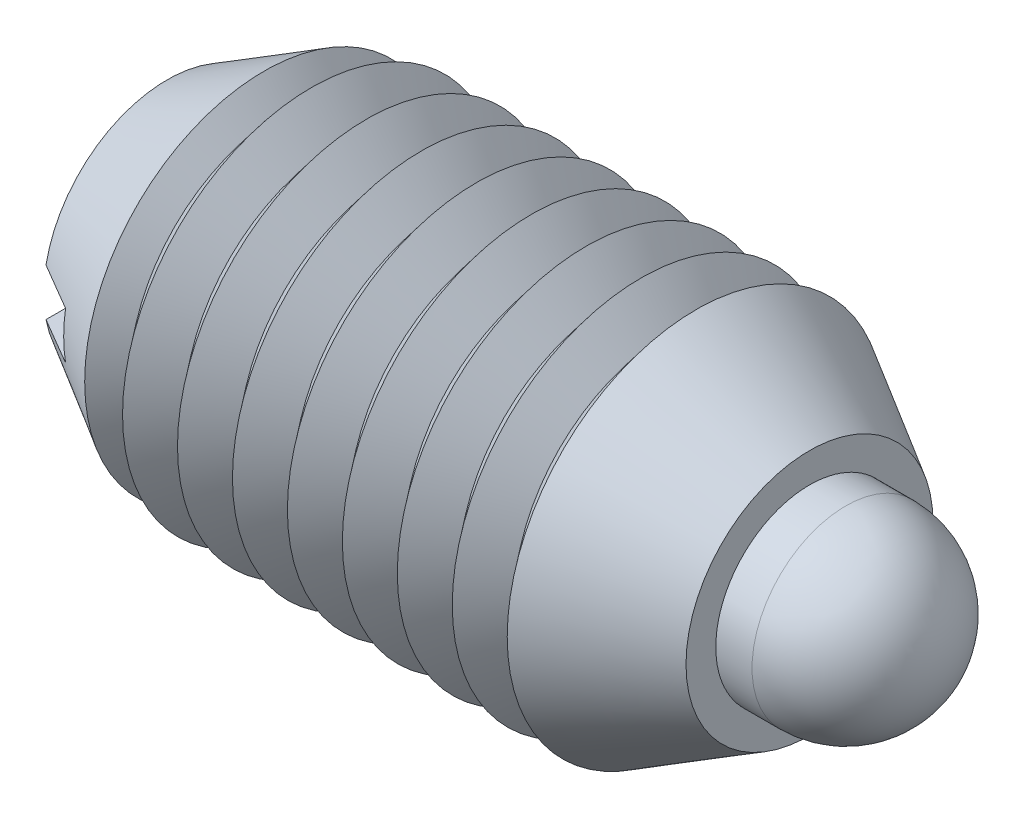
ISO-10303-21;
HEADER;
FILE_DESCRIPTION(('STEP AP214'),'2;1');
FILE_NAME('part.step','',(''),(''),'','','');
FILE_SCHEMA(('AUTOMOTIVE_DESIGN { 1 0 10303 214 1 1 1 1 }'));
ENDSEC;
DATA;
#1=APPLICATION_CONTEXT('core data for automotive mechanical design processes');
#2=APPLICATION_PROTOCOL_DEFINITION('international standard','automotive_design',2000,#1);
#3=PRODUCT_CONTEXT('',#1,'mechanical');
#4=PRODUCT('Part','Part','',(#3));
#5=PRODUCT_RELATED_PRODUCT_CATEGORY('part','',(#4));
#6=PRODUCT_DEFINITION_FORMATION('','',#4);
#7=PRODUCT_DEFINITION_CONTEXT('part definition',#1,'design');
#8=PRODUCT_DEFINITION('design','',#6,#7);
#9=PRODUCT_DEFINITION_SHAPE('','',#8);
#10=(LENGTH_UNIT() NAMED_UNIT(*) SI_UNIT(.MILLI.,.METRE.));
#11=(NAMED_UNIT(*) PLANE_ANGLE_UNIT() SI_UNIT($,.RADIAN.));
#12=(NAMED_UNIT(*) SI_UNIT($,.STERADIAN.) SOLID_ANGLE_UNIT());
#13=UNCERTAINTY_MEASURE_WITH_UNIT(LENGTH_MEASURE(1.E-05),#10,'distance_accuracy_value','');
#14=(GEOMETRIC_REPRESENTATION_CONTEXT(3) GLOBAL_UNCERTAINTY_ASSIGNED_CONTEXT((#13)) GLOBAL_UNIT_ASSIGNED_CONTEXT((#10,
#11,#12)) REPRESENTATION_CONTEXT('',''));
#15=CARTESIAN_POINT('',(0.,0.,0.));
#16=DIRECTION('',(0.,0.,1.));
#17=DIRECTION('',(1.,0.,0.));
#18=AXIS2_PLACEMENT_3D('',#15,#16,#17);
#19=CARTESIAN_POINT('',(17.9324,0.,0.));
#20=DIRECTION('',(-1.,0.,0.));
#21=DIRECTION('',(0.,-0.719424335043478,-0.694570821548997));
#22=AXIS2_PLACEMENT_3D('',#19,#20,#21);
#23=PLANE('',#22);
#24=CARTESIAN_POINT('',(17.9324,0.,0.));
#25=DIRECTION('',(1.,0.,0.));
#26=DIRECTION('',(0.,0.719424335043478,0.694570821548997));
#27=AXIS2_PLACEMENT_3D('',#24,#25,#26);
#28=CIRCLE('',#27,3.937);
#29=CARTESIAN_POINT('',(17.9324,2.83237360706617,2.7345253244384));
#30=VERTEX_POINT('',#29);
#31=EDGE_CURVE('P0_E10',#30,#30,#28,.T.);
#32=ORIENTED_EDGE('',*,*,#31,.F.);
#33=EDGE_LOOP('',(#32));
#34=FACE_BOUND('',#33,.T.);
#35=ADVANCED_FACE('P0_F14',(#34),#23,.T.);
#36=CARTESIAN_POINT('',(18.7198,0.,0.));
#37=DIRECTION('',(1.,0.,0.));
#38=DIRECTION('',(0.,0.719424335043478,0.694570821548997));
#39=AXIS2_PLACEMENT_3D('',#36,#37,#38);
#40=CONICAL_SURFACE('',#39,4.7244,0.78539816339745);
#41=ORIENTED_EDGE('',*,*,#31,.T.);
#42=EDGE_LOOP('',(#41));
#43=FACE_BOUND('',#42,.T.);
#44=CARTESIAN_POINT('',(18.7198,0.,0.));
#45=DIRECTION('',(1.,0.,0.));
#46=DIRECTION('',(0.,0.719424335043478,0.694570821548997));
#47=AXIS2_PLACEMENT_3D('',#44,#45,#46);
#48=CIRCLE('',#47,4.7244);
#49=CARTESIAN_POINT('',(18.7198,3.39884832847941,3.28143038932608));
#50=VERTEX_POINT('',#49);
#51=EDGE_CURVE('P0_E20',#50,#50,#48,.T.);
#52=ORIENTED_EDGE('',*,*,#51,.F.);
#53=EDGE_LOOP('',(#52));
#54=FACE_BOUND('',#53,.T.);
#55=ADVANCED_FACE('P0_F54',(#43,#54),#40,.T.);
#56=CARTESIAN_POINT('',(32.4485,0.,0.));
#57=DIRECTION('',(1.,0.,0.));
#58=DIRECTION('',(0.,0.719424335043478,0.694570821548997));
#59=AXIS2_PLACEMENT_3D('',#56,#57,#58);
#60=CYLINDRICAL_SURFACE('',#59,4.7244);
#61=ORIENTED_EDGE('',*,*,#51,.T.);
#62=EDGE_LOOP('',(#61));
#63=FACE_BOUND('',#62,.T.);
#64=CARTESIAN_POINT('',(24.4425831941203,0.,0.));
#65=DIRECTION('',(1.,0.,0.));
#66=DIRECTION('',(0.,0.719424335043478,0.694570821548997));
#67=AXIS2_PLACEMENT_3D('',#64,#65,#66);
#68=CIRCLE('',#67,4.7244);
#69=CARTESIAN_POINT('',(24.4425831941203,3.39884832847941,3.28143038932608));
#70=VERTEX_POINT('',#69);
#71=EDGE_CURVE('P0_E24',#70,#70,#68,.T.);
#72=ORIENTED_EDGE('',*,*,#71,.F.);
#73=EDGE_LOOP('',(#72));
#74=FACE_BOUND('',#73,.T.);
#75=ADVANCED_FACE('P0_F50',(#63,#74),#60,.T.);
#76=CARTESIAN_POINT('',(25.8064,0.,0.));
#77=DIRECTION('',(-1.,0.,0.));
#78=DIRECTION('',(0.,-0.719424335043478,-0.694570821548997));
#79=AXIS2_PLACEMENT_3D('',#76,#77,#78);
#80=CONICAL_SURFACE('',#79,3.937,0.523598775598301);
#81=ORIENTED_EDGE('',*,*,#71,.T.);
#82=EDGE_LOOP('',(#81));
#83=FACE_BOUND('',#82,.T.);
#84=CARTESIAN_POINT('',(25.8064,0.,0.));
#85=DIRECTION('',(1.,0.,0.));
#86=DIRECTION('',(0.,0.719424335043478,0.694570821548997));
#87=AXIS2_PLACEMENT_3D('',#84,#85,#86);
#88=CIRCLE('',#87,3.937);
#89=CARTESIAN_POINT('',(25.8064,2.83237360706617,2.7345253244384));
#90=VERTEX_POINT('',#89);
#91=EDGE_CURVE('P0_E28',#90,#90,#88,.T.);
#92=ORIENTED_EDGE('',*,*,#91,.F.);
#93=EDGE_LOOP('',(#92));
#94=FACE_BOUND('',#93,.T.);
#95=ADVANCED_FACE('P0_F41',(#83,#94),#80,.T.);
#96=CARTESIAN_POINT('',(32.4485,0.,0.));
#97=DIRECTION('',(1.,0.,0.));
#98=DIRECTION('',(0.,0.719424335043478,0.694570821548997));
#99=AXIS2_PLACEMENT_3D('',#96,#97,#98);
#100=CYLINDRICAL_SURFACE('',#99,3.937);
#101=ORIENTED_EDGE('',*,*,#91,.T.);
#102=EDGE_LOOP('',(#101));
#103=FACE_BOUND('',#102,.T.);
#104=CARTESIAN_POINT('',(28.5115,0.,0.));
#105=DIRECTION('',(1.,0.,0.));
#106=DIRECTION('',(0.,0.719424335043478,0.694570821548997));
#107=AXIS2_PLACEMENT_3D('',#104,#105,#106);
#108=CIRCLE('',#107,3.937);
#109=CARTESIAN_POINT('',(28.5115,2.83237360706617,2.7345253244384));
#110=VERTEX_POINT('',#109);
#111=EDGE_CURVE('P0_E33',#110,#110,#108,.T.);
#112=ORIENTED_EDGE('',*,*,#111,.F.);
#113=EDGE_LOOP('',(#112));
#114=FACE_BOUND('',#113,.T.);
#115=ADVANCED_FACE('P0_F39',(#103,#114),#100,.T.);
#116=CARTESIAN_POINT('',(28.5115,0.,0.));
#117=DIRECTION('',(1.,0.,0.));
#118=DIRECTION('',(0.,0.719424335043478,0.694570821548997));
#119=AXIS2_PLACEMENT_3D('',#116,#117,#118);
#120=SPHERICAL_SURFACE('',#119,3.937);
#121=ORIENTED_EDGE('',*,*,#111,.T.);
#122=EDGE_LOOP('',(#121));
#123=FACE_BOUND('',#122,.T.);
#124=ADVANCED_FACE('P0_F37',(#123),#120,.T.);
#125=CLOSED_SHELL('',(#35,#55,#75,#95,#115,#124));
#126=MANIFOLD_SOLID_BREP('P0_B1',#125);
#127=CARTESIAN_POINT('',(26.9875,0.,0.));
#128=DIRECTION('',(1.,0.,0.));
#129=DIRECTION('',(0.,0.,-1.));
#130=AXIS2_PLACEMENT_3D('',#127,#128,#129);
#131=PLANE('',#130);
#132=CARTESIAN_POINT('',(26.9875,0.,0.));
#133=DIRECTION('',(1.,0.,0.));
#134=DIRECTION('',(0.,0.,-1.));
#135=AXIS2_PLACEMENT_3D('',#132,#133,#134);
#136=CIRCLE('',#135,5.18786934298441);
#137=CARTESIAN_POINT('',(26.9875,0.,-5.18786934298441));
#138=VERTEX_POINT('',#137);
#139=EDGE_CURVE('P1_E78',#138,#138,#136,.T.);
#140=ORIENTED_EDGE('',*,*,#139,.T.);
#141=EDGE_LOOP('',(#140));
#142=FACE_BOUND('',#141,.T.);
#143=CARTESIAN_POINT('',(26.9875,0.,0.));
#144=DIRECTION('',(-1.,0.,0.));
#145=DIRECTION('',(0.,0.,1.));
#146=AXIS2_PLACEMENT_3D('',#143,#144,#145);
#147=CIRCLE('',#146,3.937);
#148=CARTESIAN_POINT('',(26.9875,0.,3.937));
#149=VERTEX_POINT('',#148);
#150=EDGE_CURVE('P1_E65',#149,#149,#147,.T.);
#151=ORIENTED_EDGE('',*,*,#150,.T.);
#152=EDGE_LOOP('',(#151));
#153=FACE_BOUND('',#152,.T.);
#154=ADVANCED_FACE('P1_F15',(#142,#153),#131,.T.);
#155=CARTESIAN_POINT('',(26.9875,0.,0.));
#156=DIRECTION('',(-1.,0.,0.));
#157=DIRECTION('',(0.,0.,1.));
#158=AXIS2_PLACEMENT_3D('',#155,#156,#157);
#159=CONICAL_SURFACE('',#158,5.18786934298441,0.523598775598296);
#160=CARTESIAN_POINT('',(22.225,0.,0.));
#161=DIRECTION('',(-1.,0.,0.));
#162=DIRECTION('',(0.,0.,1.));
#163=AXIS2_PLACEMENT_3D('',#160,#161,#162);
#164=CIRCLE('',#163,7.9375);
#165=CARTESIAN_POINT('',(22.225,0.,7.9375));
#166=VERTEX_POINT('',#165);
#167=EDGE_CURVE('P1_E127',#166,#166,#164,.T.);
#168=ORIENTED_EDGE('',*,*,#167,.F.);
#169=EDGE_LOOP('',(#168));
#170=FACE_BOUND('',#169,.T.);
#171=ORIENTED_EDGE('',*,*,#139,.F.);
#172=EDGE_LOOP('',(#171));
#173=FACE_BOUND('',#172,.T.);
#174=ADVANCED_FACE('P1_F17',(#170,#173),#159,.T.);
#175=CARTESIAN_POINT('',(0.,0.,0.));
#176=DIRECTION('',(-1.,0.,0.));
#177=DIRECTION('',(0.,0.,1.));
#178=AXIS2_PLACEMENT_3D('',#175,#176,#177);
#179=CYLINDRICAL_SURFACE('',#178,3.937);
#180=CARTESIAN_POINT('',(25.8064,0.,0.));
#181=DIRECTION('',(-1.,0.,0.));
#182=DIRECTION('',(0.,0.,1.));
#183=AXIS2_PLACEMENT_3D('',#180,#181,#182);
#184=CIRCLE('',#183,3.937);
#185=CARTESIAN_POINT('',(25.8064,0.,3.937));
#186=VERTEX_POINT('',#185);
#187=EDGE_CURVE('P1_E115',#186,#186,#184,.T.);
#188=ORIENTED_EDGE('',*,*,#187,.T.);
#189=EDGE_LOOP('',(#188));
#190=FACE_BOUND('',#189,.T.);
#191=ORIENTED_EDGE('',*,*,#150,.F.);
#192=EDGE_LOOP('',(#191));
#193=FACE_BOUND('',#192,.T.);
#194=ADVANCED_FACE('P1_F196',(#190,#193),#179,.F.);
#195=CARTESIAN_POINT('',(25.8064,0.,0.));
#196=DIRECTION('',(-1.,0.,0.));
#197=DIRECTION('',(0.,0.,1.));
#198=AXIS2_PLACEMENT_3D('',#195,#196,#197);
#199=CONICAL_SURFACE('',#198,3.937,0.785398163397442);
#200=CARTESIAN_POINT('',(25.019,0.,0.));
#201=DIRECTION('',(-1.,0.,0.));
#202=DIRECTION('',(0.,0.,1.));
#203=AXIS2_PLACEMENT_3D('',#200,#201,#202);
#204=CIRCLE('',#203,4.7244);
#205=CARTESIAN_POINT('',(25.019,0.,4.7244));
#206=VERTEX_POINT('',#205);
#207=EDGE_CURVE('P1_E118',#206,#206,#204,.T.);
#208=ORIENTED_EDGE('',*,*,#207,.T.);
#209=EDGE_LOOP('',(#208));
#210=FACE_BOUND('',#209,.T.);
#211=ORIENTED_EDGE('',*,*,#187,.F.);
#212=EDGE_LOOP('',(#211));
#213=FACE_BOUND('',#212,.T.);
#214=ADVANCED_FACE('P1_F203',(#210,#213),#199,.F.);
#215=CARTESIAN_POINT('',(0.,0.,0.));
#216=DIRECTION('',(-1.,0.,0.));
#217=DIRECTION('',(0.,0.,1.));
#218=AXIS2_PLACEMENT_3D('',#215,#216,#217);
#219=CYLINDRICAL_SURFACE('',#218,4.7244);
#220=CARTESIAN_POINT('',(5.953125,0.,0.));
#221=DIRECTION('',(-1.,0.,0.));
#222=DIRECTION('',(0.,0.,1.));
#223=AXIS2_PLACEMENT_3D('',#220,#221,#222);
#224=CIRCLE('',#223,4.7244);
#225=CARTESIAN_POINT('',(5.953125,0.,4.7244));
#226=VERTEX_POINT('',#225);
#227=EDGE_CURVE('P1_E121',#226,#226,#224,.T.);
#228=ORIENTED_EDGE('',*,*,#227,.T.);
#229=EDGE_LOOP('',(#228));
#230=FACE_BOUND('',#229,.T.);
#231=ORIENTED_EDGE('',*,*,#207,.F.);
#232=EDGE_LOOP('',(#231));
#233=FACE_BOUND('',#232,.T.);
#234=ADVANCED_FACE('P1_F208',(#230,#233),#219,.F.);
#235=CARTESIAN_POINT('',(5.953125,0.,0.));
#236=DIRECTION('',(1.,0.,0.));
#237=DIRECTION('',(0.,0.,-1.));
#238=AXIS2_PLACEMENT_3D('',#235,#236,#237);
#239=PLANE('',#238);
#240=ORIENTED_EDGE('',*,*,#227,.F.);
#241=EDGE_LOOP('',(#240));
#242=FACE_BOUND('',#241,.T.);
#243=ADVANCED_FACE('P1_F214',(#242),#239,.T.);
#244=CARTESIAN_POINT('',(21.0704545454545,0.,0.));
#245=DIRECTION('',(1.,0.,0.));
#246=DIRECTION('',(0.,0.,-1.));
#247=AXIS2_PLACEMENT_3D('',#244,#245,#246);
#248=CONICAL_SURFACE('',#247,6.49547318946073,0.895664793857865);
#249=ORIENTED_EDGE('',*,*,#167,.T.);
#250=EDGE_LOOP('',(#249));
#251=FACE_BOUND('',#250,.T.);
#252=CARTESIAN_POINT('',(21.0704545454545,0.,0.));
#253=DIRECTION('',(-1.,0.,0.));
#254=DIRECTION('',(0.,0.,1.));
#255=AXIS2_PLACEMENT_3D('',#252,#253,#254);
#256=CIRCLE('',#255,6.49547318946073);
#257=CARTESIAN_POINT('',(21.0704545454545,0.,6.49547318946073));
#258=VERTEX_POINT('',#257);
#259=EDGE_CURVE('P1_E124',#258,#258,#256,.T.);
#260=ORIENTED_EDGE('',*,*,#259,.F.);
#261=EDGE_LOOP('',(#260));
#262=FACE_BOUND('',#261,.T.);
#263=ADVANCED_FACE('P1_F218',(#251,#262),#248,.T.);
#264=CARTESIAN_POINT('',(19.9159090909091,0.,0.));
#265=DIRECTION('',(-1.,0.,0.));
#266=DIRECTION('',(0.,0.,1.));
#267=AXIS2_PLACEMENT_3D('',#264,#265,#266);
#268=CONICAL_SURFACE('',#267,7.9375,0.895664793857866);
#269=ORIENTED_EDGE('',*,*,#259,.T.);
#270=EDGE_LOOP('',(#269));
#271=FACE_BOUND('',#270,.T.);
#272=CARTESIAN_POINT('',(19.9159090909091,0.,0.));
#273=DIRECTION('',(-1.,0.,0.));
#274=DIRECTION('',(0.,0.,1.));
#275=AXIS2_PLACEMENT_3D('',#272,#273,#274);
#276=CIRCLE('',#275,7.9375);
#277=CARTESIAN_POINT('',(19.9159090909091,0.,7.9375));
#278=VERTEX_POINT('',#277);
#279=EDGE_CURVE('P1_E133',#278,#278,#276,.T.);
#280=ORIENTED_EDGE('',*,*,#279,.F.);
#281=EDGE_LOOP('',(#280));
#282=FACE_BOUND('',#281,.T.);
#283=ADVANCED_FACE('P1_F222',(#271,#282),#268,.T.);
#284=CARTESIAN_POINT('',(18.7613636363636,0.,0.));
#285=DIRECTION('',(1.,0.,0.));
#286=DIRECTION('',(0.,0.,-1.));
#287=AXIS2_PLACEMENT_3D('',#284,#285,#286);
#288=CONICAL_SURFACE('',#287,6.49547318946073,0.895664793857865);
#289=ORIENTED_EDGE('',*,*,#279,.T.);
#290=EDGE_LOOP('',(#289));
#291=FACE_BOUND('',#290,.T.);
#292=CARTESIAN_POINT('',(18.7613636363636,0.,0.));
#293=DIRECTION('',(-1.,0.,0.));
#294=DIRECTION('',(0.,0.,1.));
#295=AXIS2_PLACEMENT_3D('',#292,#293,#294);
#296=CIRCLE('',#295,6.49547318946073);
#297=CARTESIAN_POINT('',(18.7613636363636,0.,6.49547318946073));
#298=VERTEX_POINT('',#297);
#299=EDGE_CURVE('P1_E130',#298,#298,#296,.T.);
#300=ORIENTED_EDGE('',*,*,#299,.F.);
#301=EDGE_LOOP('',(#300));
#302=FACE_BOUND('',#301,.T.);
#303=ADVANCED_FACE('P1_F226',(#291,#302),#288,.T.);
#304=CARTESIAN_POINT('',(17.6068181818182,0.,0.));
#305=DIRECTION('',(-1.,0.,0.));
#306=DIRECTION('',(0.,0.,1.));
#307=AXIS2_PLACEMENT_3D('',#304,#305,#306);
#308=CONICAL_SURFACE('',#307,7.9375,0.895664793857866);
#309=ORIENTED_EDGE('',*,*,#299,.T.);
#310=EDGE_LOOP('',(#309));
#311=FACE_BOUND('',#310,.T.);
#312=CARTESIAN_POINT('',(17.6068181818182,0.,0.));
#313=DIRECTION('',(-1.,0.,0.));
#314=DIRECTION('',(0.,0.,1.));
#315=AXIS2_PLACEMENT_3D('',#312,#313,#314);
#316=CIRCLE('',#315,7.9375);
#317=CARTESIAN_POINT('',(17.6068181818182,0.,7.9375));
#318=VERTEX_POINT('',#317);
#319=EDGE_CURVE('P1_E139',#318,#318,#316,.T.);
#320=ORIENTED_EDGE('',*,*,#319,.F.);
#321=EDGE_LOOP('',(#320));
#322=FACE_BOUND('',#321,.T.);
#323=ADVANCED_FACE('P1_F230',(#311,#322),#308,.T.);
#324=CARTESIAN_POINT('',(16.4522727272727,0.,0.));
#325=DIRECTION('',(1.,0.,0.));
#326=DIRECTION('',(0.,0.,-1.));
#327=AXIS2_PLACEMENT_3D('',#324,#325,#326);
#328=CONICAL_SURFACE('',#327,6.49547318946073,0.895664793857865);
#329=ORIENTED_EDGE('',*,*,#319,.T.);
#330=EDGE_LOOP('',(#329));
#331=FACE_BOUND('',#330,.T.);
#332=CARTESIAN_POINT('',(16.4522727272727,0.,0.));
#333=DIRECTION('',(-1.,0.,0.));
#334=DIRECTION('',(0.,0.,1.));
#335=AXIS2_PLACEMENT_3D('',#332,#333,#334);
#336=CIRCLE('',#335,6.49547318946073);
#337=CARTESIAN_POINT('',(16.4522727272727,0.,6.49547318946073));
#338=VERTEX_POINT('',#337);
#339=EDGE_CURVE('P1_E136',#338,#338,#336,.T.);
#340=ORIENTED_EDGE('',*,*,#339,.F.);
#341=EDGE_LOOP('',(#340));
#342=FACE_BOUND('',#341,.T.);
#343=ADVANCED_FACE('P1_F234',(#331,#342),#328,.T.);
#344=CARTESIAN_POINT('',(15.2977272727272,0.,0.));
#345=DIRECTION('',(-1.,0.,0.));
#346=DIRECTION('',(0.,0.,1.));
#347=AXIS2_PLACEMENT_3D('',#344,#345,#346);
#348=CONICAL_SURFACE('',#347,7.9375,0.895664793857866);
#349=ORIENTED_EDGE('',*,*,#339,.T.);
#350=EDGE_LOOP('',(#349));
#351=FACE_BOUND('',#350,.T.);
#352=CARTESIAN_POINT('',(15.2977272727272,0.,0.));
#353=DIRECTION('',(-1.,0.,0.));
#354=DIRECTION('',(0.,0.,1.));
#355=AXIS2_PLACEMENT_3D('',#352,#353,#354);
#356=CIRCLE('',#355,7.9375);
#357=CARTESIAN_POINT('',(15.2977272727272,0.,7.9375));
#358=VERTEX_POINT('',#357);
#359=EDGE_CURVE('P1_E145',#358,#358,#356,.T.);
#360=ORIENTED_EDGE('',*,*,#359,.F.);
#361=EDGE_LOOP('',(#360));
#362=FACE_BOUND('',#361,.T.);
#363=ADVANCED_FACE('P1_F238',(#351,#362),#348,.T.);
#364=CARTESIAN_POINT('',(14.1431818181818,0.,0.));
#365=DIRECTION('',(1.,0.,0.));
#366=DIRECTION('',(0.,0.,-1.));
#367=AXIS2_PLACEMENT_3D('',#364,#365,#366);
#368=CONICAL_SURFACE('',#367,6.49547318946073,0.895664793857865);
#369=ORIENTED_EDGE('',*,*,#359,.T.);
#370=EDGE_LOOP('',(#369));
#371=FACE_BOUND('',#370,.T.);
#372=CARTESIAN_POINT('',(14.1431818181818,0.,0.));
#373=DIRECTION('',(-1.,0.,0.));
#374=DIRECTION('',(0.,0.,1.));
#375=AXIS2_PLACEMENT_3D('',#372,#373,#374);
#376=CIRCLE('',#375,6.49547318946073);
#377=CARTESIAN_POINT('',(14.1431818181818,0.,6.49547318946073));
#378=VERTEX_POINT('',#377);
#379=EDGE_CURVE('P1_E142',#378,#378,#376,.T.);
#380=ORIENTED_EDGE('',*,*,#379,.F.);
#381=EDGE_LOOP('',(#380));
#382=FACE_BOUND('',#381,.T.);
#383=ADVANCED_FACE('P1_F242',(#371,#382),#368,.T.);
#384=CARTESIAN_POINT('',(12.9886363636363,0.,0.));
#385=DIRECTION('',(-1.,0.,0.));
#386=DIRECTION('',(0.,0.,1.));
#387=AXIS2_PLACEMENT_3D('',#384,#385,#386);
#388=CONICAL_SURFACE('',#387,7.9375,0.895664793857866);
#389=ORIENTED_EDGE('',*,*,#379,.T.);
#390=EDGE_LOOP('',(#389));
#391=FACE_BOUND('',#390,.T.);
#392=CARTESIAN_POINT('',(12.9886363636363,0.,0.));
#393=DIRECTION('',(-1.,0.,0.));
#394=DIRECTION('',(0.,0.,1.));
#395=AXIS2_PLACEMENT_3D('',#392,#393,#394);
#396=CIRCLE('',#395,7.9375);
#397=CARTESIAN_POINT('',(12.9886363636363,0.,7.9375));
#398=VERTEX_POINT('',#397);
#399=EDGE_CURVE('P1_E151',#398,#398,#396,.T.);
#400=ORIENTED_EDGE('',*,*,#399,.F.);
#401=EDGE_LOOP('',(#400));
#402=FACE_BOUND('',#401,.T.);
#403=ADVANCED_FACE('P1_F246',(#391,#402),#388,.T.);
#404=CARTESIAN_POINT('',(11.8340909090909,0.,0.));
#405=DIRECTION('',(1.,0.,0.));
#406=DIRECTION('',(0.,0.,-1.));
#407=AXIS2_PLACEMENT_3D('',#404,#405,#406);
#408=CONICAL_SURFACE('',#407,6.49547318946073,0.895664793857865);
#409=ORIENTED_EDGE('',*,*,#399,.T.);
#410=EDGE_LOOP('',(#409));
#411=FACE_BOUND('',#410,.T.);
#412=CARTESIAN_POINT('',(11.8340909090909,0.,0.));
#413=DIRECTION('',(-1.,0.,0.));
#414=DIRECTION('',(0.,0.,1.));
#415=AXIS2_PLACEMENT_3D('',#412,#413,#414);
#416=CIRCLE('',#415,6.49547318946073);
#417=CARTESIAN_POINT('',(11.8340909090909,0.,6.49547318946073));
#418=VERTEX_POINT('',#417);
#419=EDGE_CURVE('P1_E148',#418,#418,#416,.T.);
#420=ORIENTED_EDGE('',*,*,#419,.F.);
#421=EDGE_LOOP('',(#420));
#422=FACE_BOUND('',#421,.T.);
#423=ADVANCED_FACE('P1_F250',(#411,#422),#408,.T.);
#424=CARTESIAN_POINT('',(10.6795454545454,0.,0.));
#425=DIRECTION('',(-1.,0.,0.));
#426=DIRECTION('',(0.,0.,1.));
#427=AXIS2_PLACEMENT_3D('',#424,#425,#426);
#428=CONICAL_SURFACE('',#427,7.9375,0.895664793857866);
#429=ORIENTED_EDGE('',*,*,#419,.T.);
#430=EDGE_LOOP('',(#429));
#431=FACE_BOUND('',#430,.T.);
#432=CARTESIAN_POINT('',(10.6795454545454,0.,0.));
#433=DIRECTION('',(-1.,0.,0.));
#434=DIRECTION('',(0.,0.,1.));
#435=AXIS2_PLACEMENT_3D('',#432,#433,#434);
#436=CIRCLE('',#435,7.9375);
#437=CARTESIAN_POINT('',(10.6795454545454,0.,7.9375));
#438=VERTEX_POINT('',#437);
#439=EDGE_CURVE('P1_E157',#438,#438,#436,.T.);
#440=ORIENTED_EDGE('',*,*,#439,.F.);
#441=EDGE_LOOP('',(#440));
#442=FACE_BOUND('',#441,.T.);
#443=ADVANCED_FACE('P1_F254',(#431,#442),#428,.T.);
#444=CARTESIAN_POINT('',(9.52499999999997,0.,0.));
#445=DIRECTION('',(1.,0.,0.));
#446=DIRECTION('',(0.,0.,-1.));
#447=AXIS2_PLACEMENT_3D('',#444,#445,#446);
#448=CONICAL_SURFACE('',#447,6.49547318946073,0.895664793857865);
#449=ORIENTED_EDGE('',*,*,#439,.T.);
#450=EDGE_LOOP('',(#449));
#451=FACE_BOUND('',#450,.T.);
#452=CARTESIAN_POINT('',(9.52499999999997,0.,0.));
#453=DIRECTION('',(-1.,0.,0.));
#454=DIRECTION('',(0.,0.,1.));
#455=AXIS2_PLACEMENT_3D('',#452,#453,#454);
#456=CIRCLE('',#455,6.49547318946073);
#457=CARTESIAN_POINT('',(9.52499999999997,0.,6.49547318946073));
#458=VERTEX_POINT('',#457);
#459=EDGE_CURVE('P1_E154',#458,#458,#456,.T.);
#460=ORIENTED_EDGE('',*,*,#459,.F.);
#461=EDGE_LOOP('',(#460));
#462=FACE_BOUND('',#461,.T.);
#463=ADVANCED_FACE('P1_F258',(#451,#462),#448,.T.);
#464=CARTESIAN_POINT('',(8.37045454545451,0.,0.));
#465=DIRECTION('',(-1.,0.,0.));
#466=DIRECTION('',(0.,0.,1.));
#467=AXIS2_PLACEMENT_3D('',#464,#465,#466);
#468=CONICAL_SURFACE('',#467,7.9375,0.895664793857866);
#469=ORIENTED_EDGE('',*,*,#459,.T.);
#470=EDGE_LOOP('',(#469));
#471=FACE_BOUND('',#470,.T.);
#472=CARTESIAN_POINT('',(8.37045454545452,0.,0.));
#473=DIRECTION('',(-1.,0.,0.));
#474=DIRECTION('',(0.,0.,1.));
#475=AXIS2_PLACEMENT_3D('',#472,#473,#474);
#476=CIRCLE('',#475,7.9375);
#477=CARTESIAN_POINT('',(8.37045454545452,0.,7.9375));
#478=VERTEX_POINT('',#477);
#479=EDGE_CURVE('P1_E163',#478,#478,#476,.T.);
#480=ORIENTED_EDGE('',*,*,#479,.F.);
#481=EDGE_LOOP('',(#480));
#482=FACE_BOUND('',#481,.T.);
#483=ADVANCED_FACE('P1_F188',(#471,#482),#468,.T.);
#484=CARTESIAN_POINT('',(7.21590909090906,0.,0.));
#485=DIRECTION('',(1.,0.,0.));
#486=DIRECTION('',(0.,0.,-1.));
#487=AXIS2_PLACEMENT_3D('',#484,#485,#486);
#488=CONICAL_SURFACE('',#487,6.49547318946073,0.895664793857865);
#489=ORIENTED_EDGE('',*,*,#479,.T.);
#490=EDGE_LOOP('',(#489));
#491=FACE_BOUND('',#490,.T.);
#492=CARTESIAN_POINT('',(7.21590909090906,0.,0.));
#493=DIRECTION('',(-1.,0.,0.));
#494=DIRECTION('',(0.,0.,1.));
#495=AXIS2_PLACEMENT_3D('',#492,#493,#494);
#496=CIRCLE('',#495,6.49547318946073);
#497=CARTESIAN_POINT('',(7.21590909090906,0.,6.49547318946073));
#498=VERTEX_POINT('',#497);
#499=EDGE_CURVE('P1_E160',#498,#498,#496,.T.);
#500=ORIENTED_EDGE('',*,*,#499,.F.);
#501=EDGE_LOOP('',(#500));
#502=FACE_BOUND('',#501,.T.);
#503=ADVANCED_FACE('P1_F178',(#491,#502),#488,.T.);
#504=CARTESIAN_POINT('',(6.06136363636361,0.,0.));
#505=DIRECTION('',(-1.,0.,0.));
#506=DIRECTION('',(0.,0.,1.));
#507=AXIS2_PLACEMENT_3D('',#504,#505,#506);
#508=CONICAL_SURFACE('',#507,7.9375,0.895664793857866);
#509=ORIENTED_EDGE('',*,*,#499,.T.);
#510=EDGE_LOOP('',(#509));
#511=FACE_BOUND('',#510,.T.);
#512=CARTESIAN_POINT('',(6.06136363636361,0.,0.));
#513=DIRECTION('',(-1.,0.,0.));
#514=DIRECTION('',(0.,0.,1.));
#515=AXIS2_PLACEMENT_3D('',#512,#513,#514);
#516=CIRCLE('',#515,7.9375);
#517=CARTESIAN_POINT('',(6.06136363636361,0.,7.9375));
#518=VERTEX_POINT('',#517);
#519=EDGE_CURVE('P1_E169',#518,#518,#516,.T.);
#520=ORIENTED_EDGE('',*,*,#519,.F.);
#521=EDGE_LOOP('',(#520));
#522=FACE_BOUND('',#521,.T.);
#523=ADVANCED_FACE('P1_F176',(#511,#522),#508,.T.);
#524=CARTESIAN_POINT('',(4.90681818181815,0.,0.));
#525=DIRECTION('',(1.,0.,0.));
#526=DIRECTION('',(0.,0.,-1.));
#527=AXIS2_PLACEMENT_3D('',#524,#525,#526);
#528=CONICAL_SURFACE('',#527,6.49547318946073,0.895664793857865);
#529=ORIENTED_EDGE('',*,*,#519,.T.);
#530=EDGE_LOOP('',(#529));
#531=FACE_BOUND('',#530,.T.);
#532=CARTESIAN_POINT('',(4.90681818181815,0.,0.));
#533=DIRECTION('',(-1.,0.,0.));
#534=DIRECTION('',(0.,0.,1.));
#535=AXIS2_PLACEMENT_3D('',#532,#533,#534);
#536=CIRCLE('',#535,6.49547318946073);
#537=CARTESIAN_POINT('',(4.90681818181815,0.,6.49547318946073));
#538=VERTEX_POINT('',#537);
#539=EDGE_CURVE('P1_E166',#538,#538,#536,.T.);
#540=ORIENTED_EDGE('',*,*,#539,.F.);
#541=EDGE_LOOP('',(#540));
#542=FACE_BOUND('',#541,.T.);
#543=ADVANCED_FACE('P1_F173',(#531,#542),#528,.T.);
#544=CARTESIAN_POINT('',(3.7522727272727,0.,0.));
#545=DIRECTION('',(-1.,0.,0.));
#546=DIRECTION('',(0.,0.,1.));
#547=AXIS2_PLACEMENT_3D('',#544,#545,#546);
#548=CONICAL_SURFACE('',#547,7.9375,0.895664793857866);
#549=CARTESIAN_POINT('',(4.07162828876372,0.,0.));
#550=DIRECTION('',(-1.,0.,0.));
#551=DIRECTION('',(0.,0.,1.));
#552=AXIS2_PLACEMENT_3D('',#549,#550,#551);
#553=CIRCLE('',#552,7.53862503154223);
#554=CARTESIAN_POINT('',(4.07162828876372,0.,7.53862503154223));
#555=VERTEX_POINT('',#554);
#556=EDGE_CURVE('P1_E19',#555,#555,#553,.T.);
#557=ORIENTED_EDGE('',*,*,#556,.F.);
#558=EDGE_LOOP('',(#557));
#559=FACE_BOUND('',#558,.T.);
#560=ORIENTED_EDGE('',*,*,#539,.T.);
#561=EDGE_LOOP('',(#560));
#562=FACE_BOUND('',#561,.T.);
#563=ADVANCED_FACE('P1_F186',(#559,#562),#548,.T.);
#564=CARTESIAN_POINT('',(0.,0.,0.));
#565=DIRECTION('',(1.,0.,0.));
#566=DIRECTION('',(0.,0.,-1.));
#567=AXIS2_PLACEMENT_3D('',#564,#565,#566);
#568=PLANE('',#567);
#569=CARTESIAN_POINT('',(0.,0.,0.));
#570=DIRECTION('',(1.,0.,0.));
#571=DIRECTION('',(0.,0.,-1.));
#572=AXIS2_PLACEMENT_3D('',#569,#570,#571);
#573=CIRCLE('',#572,5.18786934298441);
#574=CARTESIAN_POINT('',(0.,-0.9921875,-5.09210686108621));
#575=VERTEX_POINT('',#574);
#576=CARTESIAN_POINT('',(0.,-0.9921875,5.09210686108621));
#577=VERTEX_POINT('',#576);
#578=EDGE_CURVE('P1_E74',#575,#577,#573,.F.);
#579=ORIENTED_EDGE('',*,*,#578,.T.);
#580=DIRECTION('',(0.,0.,1.));
#581=VECTOR('',#580,1.);
#582=CARTESIAN_POINT('',(0.,-0.9921875,-7.9375));
#583=LINE('',#582,#581);
#584=EDGE_CURVE('P1_E32',#575,#577,#583,.T.);
#585=ORIENTED_EDGE('',*,*,#584,.F.);
#586=EDGE_LOOP('',(#579,#585));
#587=FACE_BOUND('',#586,.T.);
#588=ADVANCED_FACE('P1_F100',(#587),#568,.F.);
#589=CARTESIAN_POINT('',(0.,-0.9921875,-7.9375));
#590=DIRECTION('',(0.,-1.,0.));
#591=DIRECTION('',(0.,0.,-1.));
#592=AXIS2_PLACEMENT_3D('',#589,#590,#591);
#593=PLANE('',#592);
#594=CARTESIAN_POINT('',(11.583700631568,-0.9921875,-11.8342020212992));
#595=CARTESIAN_POINT('',(11.00534714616,-0.9921875,-11.4991132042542));
#596=CARTESIAN_POINT('',(10.4270328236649,-0.9921875,-11.163956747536));
#597=CARTESIAN_POINT('',(9.27051702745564,-0.9921875,-10.4934477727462));
#598=CARTESIAN_POINT('',(8.69231555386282,-0.9921875,-10.1580952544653));
#599=CARTESIAN_POINT('',(7.53594744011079,-0.9921875,-9.48706806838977));
#600=CARTESIAN_POINT('',(6.95778082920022,-0.9921875,-9.15139335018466));
#601=CARTESIAN_POINT('',(5.80165418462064,-0.9921875,-8.47968948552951));
#602=CARTESIAN_POINT('',(5.22369415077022,-0.9921875,-8.14366033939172));
#603=CARTESIAN_POINT('',(4.08313631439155,-0.9921875,-7.47986391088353));
#604=CARTESIAN_POINT('',(3.52053091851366,-0.9921875,-7.15210968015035));
#605=CARTESIAN_POINT('',(2.39573778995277,-0.9921875,-6.49588187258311));
#606=CARTESIAN_POINT('',(1.83355005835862,-0.9921875,-6.16740829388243));
#607=CARTESIAN_POINT('',(0.709928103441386,-0.9921875,-5.50939435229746));
#608=CARTESIAN_POINT('',(0.148493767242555,-0.9921875,-5.1798541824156));
#609=CARTESIAN_POINT('',(-0.692787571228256,-0.9921875,-4.68406983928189));
#610=CARTESIAN_POINT('',(-0.973069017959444,-0.9921875,-4.51856308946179));
#611=CARTESIAN_POINT('',(-1.53322567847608,-0.9921875,-4.18686356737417));
#612=CARTESIAN_POINT('',(-1.81310089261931,-0.9921875,-4.02067079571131));
#613=CARTESIAN_POINT('',(-2.37380632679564,-0.9921875,-3.68639161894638));
#614=CARTESIAN_POINT('',(-2.65463333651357,-0.9921875,-3.51829982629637));
#615=CARTESIAN_POINT('',(-3.21549865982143,-0.9921875,-3.18058549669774));
#616=CARTESIAN_POINT('',(-3.49553667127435,-0.9921875,-3.01096245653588));
#617=CARTESIAN_POINT('',(-3.91594297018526,-0.9921875,-2.75384833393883));
#618=CARTESIAN_POINT('',(-4.05685597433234,-0.9921875,-2.66724852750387));
#619=CARTESIAN_POINT('',(-4.33817797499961,-0.9921875,-2.49323481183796));
#620=CARTESIAN_POINT('',(-4.47858697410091,-0.9921875,-2.40582090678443));
#621=CARTESIAN_POINT('',(-4.75858088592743,-0.9921875,-2.22997987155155));
#622=CARTESIAN_POINT('',(-4.89816646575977,-0.9921875,-2.14155380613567));
#623=CARTESIAN_POINT('',(-5.17634517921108,-0.9921875,-1.96316452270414));
#624=CARTESIAN_POINT('',(-5.31493835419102,-0.9921875,-1.87320136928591));
#625=CARTESIAN_POINT('',(-5.5907687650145,-0.9921875,-1.69094711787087));
#626=CARTESIAN_POINT('',(-5.72800473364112,-0.9921875,-1.59865408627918));
#627=CARTESIAN_POINT('',(-5.93221385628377,-0.9921875,-1.45741471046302));
#628=CARTESIAN_POINT('',(-6.0001052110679,-0.9921875,-1.40979826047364));
#629=CARTESIAN_POINT('',(-6.13504381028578,-0.9921875,-1.31340466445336));
#630=CARTESIAN_POINT('',(-6.20209119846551,-0.9921875,-1.26462772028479));
#631=CARTESIAN_POINT('',(-6.3343959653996,-0.9921875,-1.16601209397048));
#632=CARTESIAN_POINT('',(-6.39966441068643,-0.9921875,-1.11618834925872));
#633=CARTESIAN_POINT('',(-6.52856900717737,-0.9921875,-1.01448872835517));
#634=CARTESIAN_POINT('',(-6.59220546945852,-0.9921875,-0.962613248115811));
#635=CARTESIAN_POINT('',(-6.71678198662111,-0.9921875,-0.856176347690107));
#636=CARTESIAN_POINT('',(-6.77773221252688,-0.9921875,-0.801627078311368));
#637=CARTESIAN_POINT('',(-6.86607560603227,-0.9921875,-0.716662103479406));
#638=CARTESIAN_POINT('',(-6.89499289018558,-0.9921875,-0.687835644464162));
#639=CARTESIAN_POINT('',(-6.9514583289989,-0.9921875,-0.628877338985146));
#640=CARTESIAN_POINT('',(-6.97900697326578,-0.9921875,-0.598745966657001));
#641=CARTESIAN_POINT('',(-7.02474908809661,-0.9921875,-0.545573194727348));
#642=CARTESIAN_POINT('',(-7.04339424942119,-0.9921875,-0.522921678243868));
#643=CARTESIAN_POINT('',(-7.07945879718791,-0.9921875,-0.476638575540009));
#644=CARTESIAN_POINT('',(-7.09687760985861,-0.9921875,-0.453006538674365));
#645=CARTESIAN_POINT('',(-7.1300632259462,-0.9921875,-0.404711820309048));
#646=CARTESIAN_POINT('',(-7.14583527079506,-0.9921875,-0.380052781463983));
#647=CARTESIAN_POINT('',(-7.17529810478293,-0.9921875,-0.329532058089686));
#648=CARTESIAN_POINT('',(-7.18899026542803,-0.9921875,-0.303671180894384));
#649=CARTESIAN_POINT('',(-7.21654888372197,-0.9921875,-0.244528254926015));
#650=CARTESIAN_POINT('',(-7.22972348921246,-0.9921875,-0.210912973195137));
#651=CARTESIAN_POINT('',(-7.25060813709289,-0.9921875,-0.142014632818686));
#652=CARTESIAN_POINT('',(-7.25832547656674,-0.9921875,-0.1067338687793));
#653=CARTESIAN_POINT('',(-7.26718605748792,-0.9921875,-0.0350065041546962));
#654=CARTESIAN_POINT('',(-7.26827230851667,-0.9921875,0.00144750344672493));
#655=CARTESIAN_POINT('',(-7.26351978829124,-0.9921875,0.0738904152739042));
#656=CARTESIAN_POINT('',(-7.2576779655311,-0.9921875,0.109879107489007));
#657=CARTESIAN_POINT('',(-7.23818439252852,-0.9921875,0.187691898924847));
#658=CARTESIAN_POINT('',(-7.22315273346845,-0.9921875,0.229158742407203));
#659=CARTESIAN_POINT('',(-7.18684337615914,-0.9921875,0.309264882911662));
#660=CARTESIAN_POINT('',(-7.16554678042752,-0.9921875,0.347895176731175));
#661=CARTESIAN_POINT('',(-7.11187589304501,-0.9921875,0.433529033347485));
#662=CARTESIAN_POINT('',(-7.07808852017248,-0.9921875,0.47962650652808));
#663=CARTESIAN_POINT('',(-7.00625713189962,-0.9921875,0.568424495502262));
#664=CARTESIAN_POINT('',(-6.96820378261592,-0.9921875,0.611117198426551));
#665=CARTESIAN_POINT('',(-6.88913246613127,-0.9921875,0.69419495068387));
#666=CARTESIAN_POINT('',(-6.84809583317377,-0.9921875,0.734562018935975));
#667=CARTESIAN_POINT('',(-6.76423641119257,-0.9921875,0.813277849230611));
#668=CARTESIAN_POINT('',(-6.72141564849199,-0.9921875,0.851628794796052));
#669=CARTESIAN_POINT('',(-6.62970330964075,-0.9921875,0.930965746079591));
#670=CARTESIAN_POINT('',(-6.58066199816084,-0.9921875,0.971777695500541));
#671=CARTESIAN_POINT('',(-6.48144261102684,-0.9921875,1.05200024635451));
#672=CARTESIAN_POINT('',(-6.43126437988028,-0.9921875,1.09141065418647));
#673=CARTESIAN_POINT('',(-6.27944123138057,-0.9921875,1.20806322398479));
#674=CARTESIAN_POINT('',(-6.17655567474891,-0.9921875,1.28368664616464));
#675=CARTESIAN_POINT('',(-5.96863548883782,-0.9921875,1.43233912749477));
#676=CARTESIAN_POINT('',(-5.86359690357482,-0.9921875,1.50536257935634));
#677=CARTESIAN_POINT('',(-5.65226673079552,-0.9921875,1.649501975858));
#678=CARTESIAN_POINT('',(-5.54597551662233,-0.9921875,1.72061846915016));
#679=CARTESIAN_POINT('',(-5.33273519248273,-0.9921875,1.86135881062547));
#680=CARTESIAN_POINT('',(-5.22578794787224,-0.9921875,1.93098549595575));
#681=CARTESIAN_POINT('',(-5.01124784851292,-0.9921875,2.06925249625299));
#682=CARTESIAN_POINT('',(-4.90365494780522,-0.9921875,2.13789273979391));
#683=CARTESIAN_POINT('',(-4.68812207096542,-0.9921875,2.27433583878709));
#684=CARTESIAN_POINT('',(-4.58018267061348,-0.9921875,2.34213960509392));
#685=CARTESIAN_POINT('',(-4.3639390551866,-0.9921875,2.47715611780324));
#686=CARTESIAN_POINT('',(-4.25563484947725,-0.9921875,2.54436887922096));
#687=CARTESIAN_POINT('',(-3.93156636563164,-0.9921875,2.74452498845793));
#688=CARTESIAN_POINT('',(-3.71537934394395,-0.9921875,2.8767836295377));
#689=CARTESIAN_POINT('',(-3.28226425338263,-0.9921875,3.14008284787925));
#690=CARTESIAN_POINT('',(-3.06533617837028,-0.9921875,3.27112341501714));
#691=CARTESIAN_POINT('',(-2.41378017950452,-0.9921875,3.66299125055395));
#692=CARTESIAN_POINT('',(-1.9783937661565,-0.9921875,3.92255652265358));
#693=CARTESIAN_POINT('',(-1.10632405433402,-0.9921875,4.44000472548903));
#694=CARTESIAN_POINT('',(-0.669640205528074,-0.9921875,4.69788672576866));
#695=CARTESIAN_POINT('',(0.204383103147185,-0.9921875,5.21252086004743));
#696=CARTESIAN_POINT('',(0.641722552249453,-0.9921875,5.46927301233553));
#697=CARTESIAN_POINT('',(1.51655901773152,-0.9921875,5.98188539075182));
#698=CARTESIAN_POINT('',(1.95405576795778,-0.9921875,6.23774607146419));
#699=CARTESIAN_POINT('',(2.82934800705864,-0.9921875,6.74896008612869));
#700=CARTESIAN_POINT('',(3.26714349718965,-0.9921875,7.00431341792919));
#701=CARTESIAN_POINT('',(4.58071196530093,-0.9921875,7.76975904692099));
#702=CARTESIAN_POINT('',(5.45679816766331,-0.9921875,8.27931373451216));
#703=CARTESIAN_POINT('',(6.77042512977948,-0.9921875,9.04254783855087));
#704=CARTESIAN_POINT('',(7.20779070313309,-0.9921875,9.29652902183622));
#705=CARTESIAN_POINT('',(8.082632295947,-0.9921875,9.80433851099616));
#706=CARTESIAN_POINT('',(8.52010831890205,-0.9921875,10.0581668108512));
#707=CARTESIAN_POINT('',(9.39524431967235,-0.9921875,10.5657600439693));
#708=CARTESIAN_POINT('',(9.83290431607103,-0.9921875,10.8195249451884));
#709=CARTESIAN_POINT('',(10.708268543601,-0.9921875,11.3269408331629));
#710=CARTESIAN_POINT('',(11.1459727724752,-0.9921875,11.5805918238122));
#711=CARTESIAN_POINT('',(11.583700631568,-0.9921875,11.8342020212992));
#712=B_SPLINE_CURVE_WITH_KNOTS('',3,(#594,#595,#596,#597,#598,#599,#600,#601,#602,#603,#604,
#605,#606,#607,#608,#609,#610,#611,#612,#613,#614,#615,#616,#617,#618,#619,#620,#621,#622,#623,
#624,#625,#626,#627,#628,#629,#630,#631,#632,#633,#634,#635,#636,#637,#638,#639,#640,#641,#642,
#643,#644,#645,#646,#647,#648,#649,#650,#651,#652,#653,#654,#655,#656,#657,#658,#659,#660,#661,
#662,#663,#664,#665,#666,#667,#668,#669,#670,#671,#672,#673,#674,#675,#676,#677,#678,#679,#680,
#681,#682,#683,#684,#685,#686,#687,#688,#689,#690,#691,#692,#693,#694,#695,#696,#697,#698,#699,
#700,#701,#702,#703,#704,#705,#706,#707,#708,#709,#710,#711),.UNSPECIFIED.,.F.,.F.,(4,2,2,2,2,2,
2,2,2,2,2,2,2,2,2,2,2,2,2,2,2,2,2,2,2,2,2,2,2,2,2,2,2,2,2,2,2,2,2,2,2,2,2,2,2,2,2,2,2,2,2,2,2,2,
2,2,2,2,4),(0.,2.00524201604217,4.01048617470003,6.01612496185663,8.02176198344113,
9.97509950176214,11.9284420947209,13.8814490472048,14.8579480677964,15.8344462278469,
16.8163135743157,17.7985162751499,18.294703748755,18.7908886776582,19.2865924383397,
19.7822754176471,20.2783842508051,20.5271502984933,20.7758733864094,21.0221777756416,
21.2684348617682,21.5136612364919,21.6361237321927,21.7585420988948,21.8465241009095,
21.9345469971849,22.0222805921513,22.1099560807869,22.2179057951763,22.325710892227,
22.4344412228,22.5432194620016,22.6747893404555,22.8067602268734,22.9777939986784,
23.1492095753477,23.3218094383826,23.4942183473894,23.6855882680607,23.8769845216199,
24.2599640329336,24.6437248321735,25.0273740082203,25.4102123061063,25.7930781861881,
26.1754818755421,26.5578758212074,27.3181729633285,28.0784764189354,29.5991300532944,
31.120563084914,32.6419713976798,34.1624356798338,35.6829063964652,38.7233917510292,
40.2406774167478,41.7580193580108,43.2757433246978,44.7934107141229),.UNSPECIFIED.);
#713=CARTESIAN_POINT('',(1.984375,-0.9921875,-6.25535004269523));
#714=VERTEX_POINT('',#713);
#715=EDGE_CURVE('P1_E91',#714,#575,#712,.T.);
#716=ORIENTED_EDGE('',*,*,#715,.T.);
#717=ORIENTED_EDGE('',*,*,#584,.T.);
#718=CARTESIAN_POINT('',(1.984375,-0.9921875,6.25535004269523));
#719=VERTEX_POINT('',#718);
#720=EDGE_CURVE('P1_E85',#577,#719,#712,.T.);
#721=ORIENTED_EDGE('',*,*,#720,.T.);
#722=DIRECTION('',(0.,0.,1.));
#723=VECTOR('',#722,1.);
#724=CARTESIAN_POINT('',(1.984375,-0.9921875,-7.9375));
#725=LINE('',#724,#723);
#726=EDGE_CURVE('P1_E79',#714,#719,#725,.T.);
#727=ORIENTED_EDGE('',*,*,#726,.F.);
#728=EDGE_LOOP('',(#716,#717,#721,#727));
#729=FACE_BOUND('',#728,.T.);
#730=ADVANCED_FACE('P1_F94',(#729),#593,.F.);
#731=CARTESIAN_POINT('',(1.984375,0.9921875,-7.9375));
#732=DIRECTION('',(1.,0.,0.));
#733=DIRECTION('',(0.,0.,-1.));
#734=AXIS2_PLACEMENT_3D('',#731,#732,#733);
#735=PLANE('',#734);
#736=CARTESIAN_POINT('',(1.984375,0.,0.));
#737=DIRECTION('',(1.,0.,0.));
#738=DIRECTION('',(0.,0.,-1.));
#739=AXIS2_PLACEMENT_3D('',#736,#737,#738);
#740=CIRCLE('',#739,6.33354878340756);
#741=CARTESIAN_POINT('',(1.984375,0.9921875,6.25535004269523));
#742=VERTEX_POINT('',#741);
#743=EDGE_CURVE('P1_E40',#719,#742,#740,.F.);
#744=ORIENTED_EDGE('',*,*,#743,.T.);
#745=DIRECTION('',(0.,0.,1.));
#746=VECTOR('',#745,1.);
#747=CARTESIAN_POINT('',(1.984375,0.9921875,-7.9375));
#748=LINE('',#747,#746);
#749=CARTESIAN_POINT('',(1.984375,0.9921875,-6.25535004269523));
#750=VERTEX_POINT('',#749);
#751=EDGE_CURVE('P1_E75',#750,#742,#748,.T.);
#752=ORIENTED_EDGE('',*,*,#751,.F.);
#753=EDGE_CURVE('P1_E24',#750,#714,#740,.F.);
#754=ORIENTED_EDGE('',*,*,#753,.T.);
#755=ORIENTED_EDGE('',*,*,#726,.T.);
#756=EDGE_LOOP('',(#744,#752,#754,#755));
#757=FACE_BOUND('',#756,.T.);
#758=ADVANCED_FACE('P1_F99',(#757),#735,.F.);
#759=CARTESIAN_POINT('',(0.,0.9921875,5.09210686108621));
#760=VERTEX_POINT('',#759);
#761=CARTESIAN_POINT('',(0.,0.9921875,-5.09210686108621));
#762=VERTEX_POINT('',#761);
#763=EDGE_CURVE('P1_E71',#760,#762,#573,.F.);
#764=ORIENTED_EDGE('',*,*,#763,.T.);
#765=DIRECTION('',(0.,0.,1.));
#766=VECTOR('',#765,1.);
#767=CARTESIAN_POINT('',(0.,0.9921875,-7.9375));
#768=LINE('',#767,#766);
#769=EDGE_CURVE('P1_E58',#762,#760,#768,.T.);
#770=ORIENTED_EDGE('',*,*,#769,.T.);
#771=EDGE_LOOP('',(#764,#770));
#772=FACE_BOUND('',#771,.T.);
#773=ADVANCED_FACE('P1_F73',(#772),#568,.F.);
#774=CARTESIAN_POINT('',(0.,0.9921875,-7.9375));
#775=DIRECTION('',(0.,1.,0.));
#776=DIRECTION('',(0.,0.,1.));
#777=AXIS2_PLACEMENT_3D('',#774,#775,#776);
#778=PLANE('',#777);
#779=CARTESIAN_POINT('',(11.583700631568,0.9921875,11.8342020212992));
#780=CARTESIAN_POINT('',(11.00534714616,0.9921875,11.4991132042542));
#781=CARTESIAN_POINT('',(10.4270328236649,0.9921875,11.163956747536));
#782=CARTESIAN_POINT('',(9.27051702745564,0.9921875,10.4934477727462));
#783=CARTESIAN_POINT('',(8.69231555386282,0.9921875,10.1580952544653));
#784=CARTESIAN_POINT('',(7.53594744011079,0.9921875,9.48706806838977));
#785=CARTESIAN_POINT('',(6.95778082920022,0.9921875,9.15139335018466));
#786=CARTESIAN_POINT('',(5.80165418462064,0.9921875,8.47968948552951));
#787=CARTESIAN_POINT('',(5.22369415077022,0.9921875,8.14366033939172));
#788=CARTESIAN_POINT('',(4.08313631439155,0.9921875,7.47986391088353));
#789=CARTESIAN_POINT('',(3.52053091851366,0.9921875,7.15210968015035));
#790=CARTESIAN_POINT('',(2.39573778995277,0.9921875,6.49588187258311));
#791=CARTESIAN_POINT('',(1.83355005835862,0.9921875,6.16740829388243));
#792=CARTESIAN_POINT('',(0.709928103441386,0.9921875,5.50939435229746));
#793=CARTESIAN_POINT('',(0.148493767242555,0.9921875,5.1798541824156));
#794=CARTESIAN_POINT('',(-0.692787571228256,0.9921875,4.68406983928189));
#795=CARTESIAN_POINT('',(-0.973069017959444,0.9921875,4.51856308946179));
#796=CARTESIAN_POINT('',(-1.53322567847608,0.9921875,4.18686356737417));
#797=CARTESIAN_POINT('',(-1.81310089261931,0.9921875,4.02067079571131));
#798=CARTESIAN_POINT('',(-2.37380632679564,0.9921875,3.68639161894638));
#799=CARTESIAN_POINT('',(-2.65463333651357,0.9921875,3.51829982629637));
#800=CARTESIAN_POINT('',(-3.21549865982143,0.9921875,3.18058549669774));
#801=CARTESIAN_POINT('',(-3.49553667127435,0.9921875,3.01096245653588));
#802=CARTESIAN_POINT('',(-3.91594297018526,0.9921875,2.75384833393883));
#803=CARTESIAN_POINT('',(-4.05685597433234,0.9921875,2.66724852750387));
#804=CARTESIAN_POINT('',(-4.33817797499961,0.9921875,2.49323481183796));
#805=CARTESIAN_POINT('',(-4.47858697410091,0.9921875,2.40582090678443));
#806=CARTESIAN_POINT('',(-4.75858088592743,0.9921875,2.22997987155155));
#807=CARTESIAN_POINT('',(-4.89816646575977,0.9921875,2.14155380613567));
#808=CARTESIAN_POINT('',(-5.17634517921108,0.9921875,1.96316452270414));
#809=CARTESIAN_POINT('',(-5.31493835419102,0.9921875,1.87320136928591));
#810=CARTESIAN_POINT('',(-5.5907687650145,0.9921875,1.69094711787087));
#811=CARTESIAN_POINT('',(-5.72800473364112,0.9921875,1.59865408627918));
#812=CARTESIAN_POINT('',(-5.93221385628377,0.9921875,1.45741471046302));
#813=CARTESIAN_POINT('',(-6.0001052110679,0.9921875,1.40979826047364));
#814=CARTESIAN_POINT('',(-6.13504381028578,0.9921875,1.31340466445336));
#815=CARTESIAN_POINT('',(-6.20209119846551,0.9921875,1.26462772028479));
#816=CARTESIAN_POINT('',(-6.3343959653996,0.9921875,1.16601209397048));
#817=CARTESIAN_POINT('',(-6.39966441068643,0.9921875,1.11618834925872));
#818=CARTESIAN_POINT('',(-6.52856900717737,0.9921875,1.01448872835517));
#819=CARTESIAN_POINT('',(-6.59220546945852,0.9921875,0.962613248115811));
#820=CARTESIAN_POINT('',(-6.71678198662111,0.9921875,0.856176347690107));
#821=CARTESIAN_POINT('',(-6.77773221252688,0.9921875,0.801627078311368));
#822=CARTESIAN_POINT('',(-6.86607560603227,0.9921875,0.716662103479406));
#823=CARTESIAN_POINT('',(-6.89499289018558,0.9921875,0.687835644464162));
#824=CARTESIAN_POINT('',(-6.9514583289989,0.9921875,0.628877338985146));
#825=CARTESIAN_POINT('',(-6.97900697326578,0.9921875,0.598745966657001));
#826=CARTESIAN_POINT('',(-7.02474908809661,0.9921875,0.545573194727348));
#827=CARTESIAN_POINT('',(-7.04339424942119,0.9921875,0.522921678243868));
#828=CARTESIAN_POINT('',(-7.07945879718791,0.9921875,0.476638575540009));
#829=CARTESIAN_POINT('',(-7.09687760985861,0.9921875,0.453006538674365));
#830=CARTESIAN_POINT('',(-7.1300632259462,0.9921875,0.404711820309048));
#831=CARTESIAN_POINT('',(-7.14583527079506,0.9921875,0.380052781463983));
#832=CARTESIAN_POINT('',(-7.17529810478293,0.9921875,0.329532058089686));
#833=CARTESIAN_POINT('',(-7.18899026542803,0.9921875,0.303671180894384));
#834=CARTESIAN_POINT('',(-7.21654888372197,0.9921875,0.244528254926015));
#835=CARTESIAN_POINT('',(-7.22972348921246,0.9921875,0.210912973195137));
#836=CARTESIAN_POINT('',(-7.25060813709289,0.9921875,0.142014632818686));
#837=CARTESIAN_POINT('',(-7.25832547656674,0.9921875,0.1067338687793));
#838=CARTESIAN_POINT('',(-7.26718605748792,0.9921875,0.0350065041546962));
#839=CARTESIAN_POINT('',(-7.26827230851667,0.9921875,-0.00144750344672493));
#840=CARTESIAN_POINT('',(-7.26351978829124,0.9921875,-0.0738904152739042));
#841=CARTESIAN_POINT('',(-7.2576779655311,0.9921875,-0.109879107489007));
#842=CARTESIAN_POINT('',(-7.23818439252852,0.9921875,-0.187691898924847));
#843=CARTESIAN_POINT('',(-7.22315273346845,0.9921875,-0.229158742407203));
#844=CARTESIAN_POINT('',(-7.18684337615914,0.9921875,-0.309264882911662));
#845=CARTESIAN_POINT('',(-7.16554678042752,0.9921875,-0.347895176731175));
#846=CARTESIAN_POINT('',(-7.11187589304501,0.9921875,-0.433529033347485));
#847=CARTESIAN_POINT('',(-7.07808852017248,0.9921875,-0.47962650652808));
#848=CARTESIAN_POINT('',(-7.00625713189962,0.9921875,-0.568424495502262));
#849=CARTESIAN_POINT('',(-6.96820378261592,0.9921875,-0.611117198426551));
#850=CARTESIAN_POINT('',(-6.88913246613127,0.9921875,-0.69419495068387));
#851=CARTESIAN_POINT('',(-6.84809583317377,0.9921875,-0.734562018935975));
#852=CARTESIAN_POINT('',(-6.76423641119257,0.9921875,-0.813277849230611));
#853=CARTESIAN_POINT('',(-6.72141564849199,0.9921875,-0.851628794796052));
#854=CARTESIAN_POINT('',(-6.62970330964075,0.9921875,-0.930965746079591));
#855=CARTESIAN_POINT('',(-6.58066199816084,0.9921875,-0.971777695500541));
#856=CARTESIAN_POINT('',(-6.48144261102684,0.9921875,-1.05200024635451));
#857=CARTESIAN_POINT('',(-6.43126437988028,0.9921875,-1.09141065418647));
#858=CARTESIAN_POINT('',(-6.27944123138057,0.9921875,-1.20806322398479));
#859=CARTESIAN_POINT('',(-6.17655567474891,0.9921875,-1.28368664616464));
#860=CARTESIAN_POINT('',(-5.96863548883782,0.9921875,-1.43233912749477));
#861=CARTESIAN_POINT('',(-5.86359690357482,0.9921875,-1.50536257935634));
#862=CARTESIAN_POINT('',(-5.65226673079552,0.9921875,-1.649501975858));
#863=CARTESIAN_POINT('',(-5.54597551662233,0.9921875,-1.72061846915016));
#864=CARTESIAN_POINT('',(-5.33273519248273,0.9921875,-1.86135881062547));
#865=CARTESIAN_POINT('',(-5.22578794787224,0.9921875,-1.93098549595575));
#866=CARTESIAN_POINT('',(-5.01124784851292,0.9921875,-2.06925249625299));
#867=CARTESIAN_POINT('',(-4.90365494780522,0.9921875,-2.13789273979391));
#868=CARTESIAN_POINT('',(-4.68812207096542,0.9921875,-2.27433583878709));
#869=CARTESIAN_POINT('',(-4.58018267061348,0.9921875,-2.34213960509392));
#870=CARTESIAN_POINT('',(-4.3639390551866,0.9921875,-2.47715611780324));
#871=CARTESIAN_POINT('',(-4.25563484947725,0.9921875,-2.54436887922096));
#872=CARTESIAN_POINT('',(-3.93156636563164,0.9921875,-2.74452498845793));
#873=CARTESIAN_POINT('',(-3.71537934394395,0.9921875,-2.8767836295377));
#874=CARTESIAN_POINT('',(-3.28226425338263,0.9921875,-3.14008284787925));
#875=CARTESIAN_POINT('',(-3.06533617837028,0.9921875,-3.27112341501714));
#876=CARTESIAN_POINT('',(-2.41378017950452,0.9921875,-3.66299125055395));
#877=CARTESIAN_POINT('',(-1.9783937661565,0.9921875,-3.92255652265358));
#878=CARTESIAN_POINT('',(-1.10632405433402,0.9921875,-4.44000472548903));
#879=CARTESIAN_POINT('',(-0.669640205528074,0.9921875,-4.69788672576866));
#880=CARTESIAN_POINT('',(0.204383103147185,0.9921875,-5.21252086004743));
#881=CARTESIAN_POINT('',(0.641722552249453,0.9921875,-5.46927301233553));
#882=CARTESIAN_POINT('',(1.51655901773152,0.9921875,-5.98188539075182));
#883=CARTESIAN_POINT('',(1.95405576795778,0.9921875,-6.23774607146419));
#884=CARTESIAN_POINT('',(2.82934800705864,0.9921875,-6.74896008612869));
#885=CARTESIAN_POINT('',(3.26714349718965,0.9921875,-7.00431341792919));
#886=CARTESIAN_POINT('',(4.58071196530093,0.9921875,-7.76975904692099));
#887=CARTESIAN_POINT('',(5.45679816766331,0.9921875,-8.27931373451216));
#888=CARTESIAN_POINT('',(6.77042512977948,0.9921875,-9.04254783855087));
#889=CARTESIAN_POINT('',(7.20779070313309,0.9921875,-9.29652902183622));
#890=CARTESIAN_POINT('',(8.082632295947,0.9921875,-9.80433851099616));
#891=CARTESIAN_POINT('',(8.52010831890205,0.9921875,-10.0581668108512));
#892=CARTESIAN_POINT('',(9.39524431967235,0.9921875,-10.5657600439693));
#893=CARTESIAN_POINT('',(9.83290431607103,0.9921875,-10.8195249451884));
#894=CARTESIAN_POINT('',(10.708268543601,0.9921875,-11.3269408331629));
#895=CARTESIAN_POINT('',(11.1459727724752,0.9921875,-11.5805918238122));
#896=CARTESIAN_POINT('',(11.583700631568,0.9921875,-11.8342020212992));
#897=B_SPLINE_CURVE_WITH_KNOTS('',3,(#779,#780,#781,#782,#783,#784,#785,#786,#787,#788,#789,
#790,#791,#792,#793,#794,#795,#796,#797,#798,#799,#800,#801,#802,#803,#804,#805,#806,#807,#808,
#809,#810,#811,#812,#813,#814,#815,#816,#817,#818,#819,#820,#821,#822,#823,#824,#825,#826,#827,
#828,#829,#830,#831,#832,#833,#834,#835,#836,#837,#838,#839,#840,#841,#842,#843,#844,#845,#846,
#847,#848,#849,#850,#851,#852,#853,#854,#855,#856,#857,#858,#859,#860,#861,#862,#863,#864,#865,
#866,#867,#868,#869,#870,#871,#872,#873,#874,#875,#876,#877,#878,#879,#880,#881,#882,#883,#884,
#885,#886,#887,#888,#889,#890,#891,#892,#893,#894,#895,#896),.UNSPECIFIED.,.F.,.F.,(4,2,2,2,2,2,
2,2,2,2,2,2,2,2,2,2,2,2,2,2,2,2,2,2,2,2,2,2,2,2,2,2,2,2,2,2,2,2,2,2,2,2,2,2,2,2,2,2,2,2,2,2,2,2,
2,2,2,2,4),(0.,2.00524201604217,4.01048617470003,6.01612496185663,8.02176198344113,
9.97509950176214,11.9284420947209,13.8814490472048,14.8579480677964,15.8344462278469,
16.8163135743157,17.7985162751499,18.294703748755,18.7908886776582,19.2865924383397,
19.7822754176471,20.2783842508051,20.5271502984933,20.7758733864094,21.0221777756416,
21.2684348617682,21.5136612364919,21.6361237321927,21.7585420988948,21.8465241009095,
21.9345469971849,22.0222805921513,22.1099560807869,22.2179057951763,22.325710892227,
22.4344412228,22.5432194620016,22.6747893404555,22.8067602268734,22.9777939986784,
23.1492095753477,23.3218094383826,23.4942183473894,23.6855882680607,23.8769845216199,
24.2599640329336,24.6437248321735,25.0273740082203,25.4102123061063,25.7930781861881,
26.1754818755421,26.5578758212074,27.3181729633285,28.0784764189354,29.5991300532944,
31.120563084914,32.6419713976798,34.1624356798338,35.6829063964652,38.7233917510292,
40.2406774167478,41.7580193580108,43.2757433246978,44.7934107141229),.UNSPECIFIED.);
#898=EDGE_CURVE('P1_E25',#742,#760,#897,.T.);
#899=ORIENTED_EDGE('',*,*,#898,.T.);
#900=ORIENTED_EDGE('',*,*,#769,.F.);
#901=EDGE_CURVE('P1_E10',#762,#750,#897,.T.);
#902=ORIENTED_EDGE('',*,*,#901,.T.);
#903=ORIENTED_EDGE('',*,*,#751,.T.);
#904=EDGE_LOOP('',(#899,#900,#902,#903));
#905=FACE_BOUND('',#904,.T.);
#906=ADVANCED_FACE('P1_F60',(#905),#778,.F.);
#907=CARTESIAN_POINT('',(4.76250000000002,0.,0.));
#908=DIRECTION('',(1.,0.,0.));
#909=DIRECTION('',(0.,0.,-1.));
#910=AXIS2_PLACEMENT_3D('',#907,#908,#909);
#911=CONICAL_SURFACE('',#910,7.9375,0.523598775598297);
#912=ORIENTED_EDGE('',*,*,#901,.F.);
#913=ORIENTED_EDGE('',*,*,#763,.F.);
#914=ORIENTED_EDGE('',*,*,#898,.F.);
#915=ORIENTED_EDGE('',*,*,#743,.F.);
#916=ORIENTED_EDGE('',*,*,#720,.F.);
#917=ORIENTED_EDGE('',*,*,#578,.F.);
#918=ORIENTED_EDGE('',*,*,#715,.F.);
#919=ORIENTED_EDGE('',*,*,#753,.F.);
#920=EDGE_LOOP('',(#912,#913,#914,#915,#916,#917,#918,#919));
#921=FACE_BOUND('',#920,.T.);
#922=ORIENTED_EDGE('',*,*,#556,.T.);
#923=EDGE_LOOP('',(#922));
#924=FACE_BOUND('',#923,.T.);
#925=ADVANCED_FACE('P1_F69',(#921,#924),#911,.T.);
#926=CLOSED_SHELL('',(#154,#174,#194,#214,#234,#243,#263,#283,#303,#323,#343,#363,#383,#403,
#423,#443,#463,#483,#503,#523,#543,#563,#588,#730,#758,#773,#906,#925));
#927=MANIFOLD_SOLID_BREP('P1_B1',#926);
#928=ADVANCED_BREP_SHAPE_REPRESENTATION('',(#18,#126,#927),#14);
#929=SHAPE_DEFINITION_REPRESENTATION(#9,#928);
ENDSEC;
END-ISO-10303-21;
